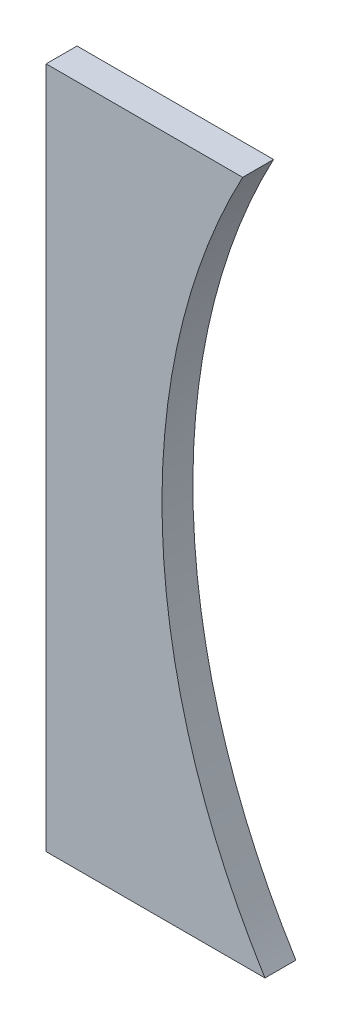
from build123d import *

# Parameters (mm, degrees)
EXTRUSION1_DEPTH = 12


with BuildPart() as part:
    # Esquisse1 → Extrusion1 (new body)
    with BuildSketch(Plane.XY):
        with BuildLine():
            Line((0, 0), (-85, 0))
            Line((-85, 0), (-85, 265))
            Line((-85, 265), (-8.666428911, 265))
            ThreePointArc((-8.666428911, 265), (-39.858402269, 131.338201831), (0, 0))
        make_face()
    extrude(amount=EXTRUSION1_DEPTH)


solid = part.part
